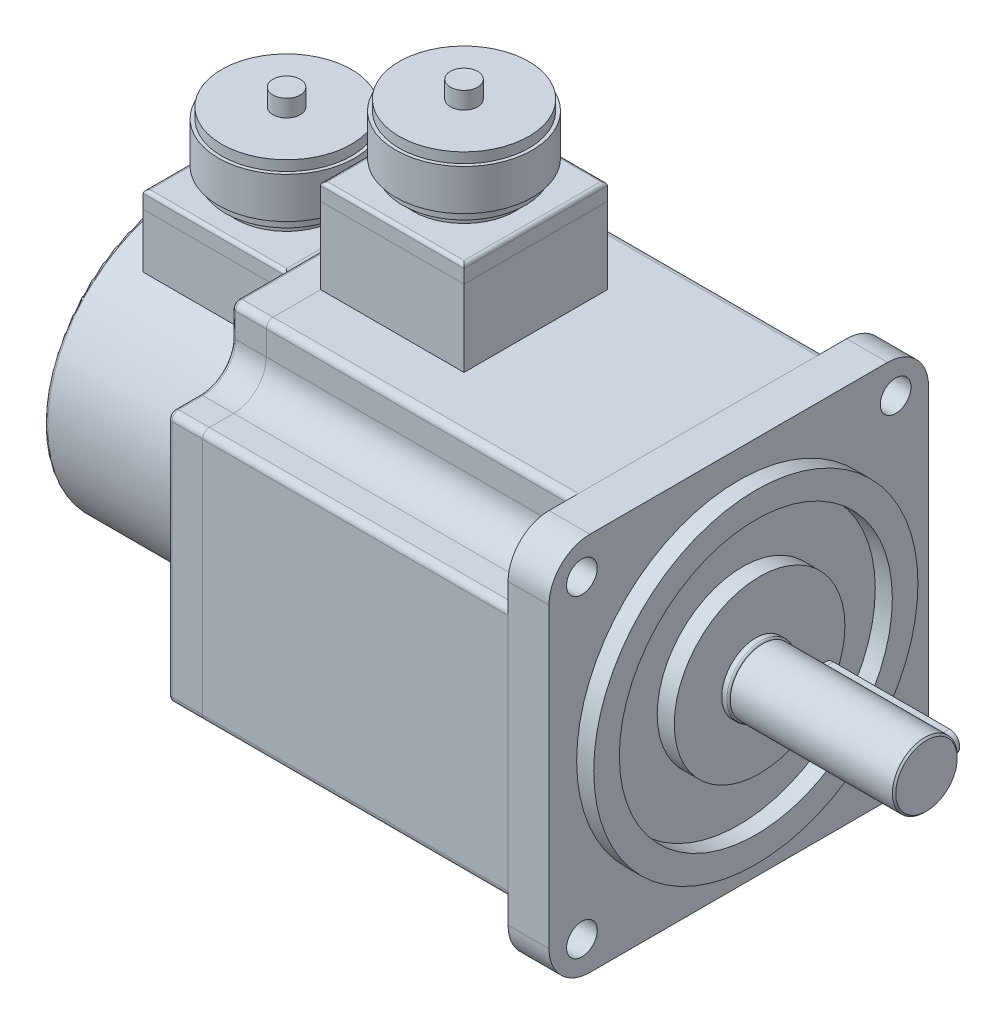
from build123d import *

# Parameters (mm, degrees)
EXTRUDE_1_DEPTH     = 10
EXTRUDE_2_DEPTH     = 89.5
EXTRUDE_3_DEPTH     = 12
CUT_EXTRUDE_1_DEPTH = 99.5
FILLET_1_R          = 1
SKETCH_7_R          = 4.5
CUT_EXTRUDE_2_DEPTH = 12
SKETCH_8_R          = 47.5
SKETCH_8_R_2        = 40
SKETCH_8_R_3        = 25
EXTRUDE_4_DEPTH     = 5
SKETCH_9_R          = 10
EXTRUDE_5_DEPTH     = 2
SKETCH_10_R         = 9.5
EXTRUDE_6_DEPTH     = 48
FILLET_2_R          = 0.5
CHAMFER_1_SIZE      = 0.5
SKETCH_13_R         = 40
EXTRUDE_8_DEPTH     = 52
SKETCH_14_W         = 42
SKETCH_14_H         = 42
CUT_EXTRUDE_4_DEPTH = 10
SKETCH_15_W         = 42
SKETCH_15_H         = 42
EXTRUDE_9_DEPTH     = 20
SKETCH_16_W         = 42
SKETCH_16_H         = 42
EXTRUDE_10_DEPTH    = 5
FILLET_3_R          = 1
SKETCH_17_R         = 15
EXTRUDE_11_DEPTH    = 3
SKETCH_18_R         = 18
EXTRUDE_12_DEPTH    = 3
SKETCH_19_R         = 20
EXTRUDE_13_DEPTH    = 12
SKETCH_20_R         = 19
EXTRUDE_14_DEPTH    = 3
SKETCH_21_R         = 4
EXTRUDE_15_DEPTH    = 5
SKETCH_22_W         = 42
SKETCH_22_H         = 42
EXTRUDE_16_DEPTH    = 22.4
SKETCH_23_W         = 42
SKETCH_23_H         = 42
EXTRUDE_17_DEPTH    = 5
FILLET_4_R          = 1
SKETCH_24_R         = 15
EXTRUDE_18_DEPTH    = 3
SKETCH_25_R         = 18
EXTRUDE_19_DEPTH    = 3
SKETCH_26_R         = 20
EXTRUDE_20_DEPTH    = 12
SKETCH_27_R         = 19
EXTRUDE_21_DEPTH    = 3
SKETCH_28_R         = 4
EXTRUDE_22_DEPTH    = 5
FILLET_5_R          = 1
CUT_EXTRUDE_5_DEPTH = 3.5
EXTRUDE_25_DEPTH    = 6


with BuildPart() as part:
    # Sketch 1 → Extrude 1 (new body)
    with BuildSketch(Plane(origin=(0, 0, 0), x_dir=(0, 0, -1), z_dir=(1, 0, 0))):
        with BuildLine():
            Line((-43.6, -55.6), (43.6, -55.6))
            ThreePointArc((43.6, -55.6), (52.085281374, -52.085281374), (55.6, -43.6))
            Line((55.6, -43.6), (55.6, 43.6))
            ThreePointArc((55.6, 43.6), (52.085281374, 52.085281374), (43.6, 55.6))
            Line((43.6, 55.6), (-43.6, 55.6))
            ThreePointArc((-43.6, 55.6), (-52.085281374, 52.085281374), (-55.6, 43.6))
            Line((-55.6, 43.6), (-55.6, -43.6))
            ThreePointArc((-55.6, -43.6), (-52.085281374, -52.085281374), (-43.6, -55.6))
        make_face()
    extrude(amount=EXTRUDE_1_DEPTH)


with BuildPart() as body_2:
    # Sketch 2 → Extrude 2 (new body)
    with BuildSketch(Plane(origin=(10, 0, 0), x_dir=(0, 0, -1), z_dir=(1, 0, 0))):
        with BuildLine():
            Line((-43.6, -55.6), (43.6, -55.6))
            ThreePointArc((43.6, -55.6), (52.085281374, -52.085281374), (55.6, -43.6))
            Line((55.6, -43.6), (55.6, 43.6))
            ThreePointArc((55.6, 43.6), (52.085281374, 52.085281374), (43.6, 55.6))
            Line((43.6, 55.6), (-43.6, 55.6))
            ThreePointArc((-43.6, 55.6), (-52.085281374, 52.085281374), (-55.6, 43.6))
            Line((-55.6, 43.6), (-55.6, -43.6))
            ThreePointArc((-55.6, -43.6), (-52.085281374, -52.085281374), (-43.6, -55.6))
        make_face()
    extrude(amount=EXTRUDE_2_DEPTH)


with BuildPart() as body_3:
    # Sketch 3 → Extrude 3 (new body)
    with BuildSketch(Plane(origin=(99.5, 0, 0), x_dir=(0, 0, -1), z_dir=(1, 0, 0))):
        with BuildLine():
            Line((-43.6, -55.6), (43.6, -55.6))
            ThreePointArc((43.6, -55.6), (52.085281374, -52.085281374), (55.6, -43.6))
            Line((55.6, -43.6), (55.6, 43.6))
            ThreePointArc((55.6, 43.6), (52.085281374, 52.085281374), (43.6, 55.6))
            Line((43.6, 55.6), (-43.6, 55.6))
            ThreePointArc((-43.6, 55.6), (-52.085281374, 52.085281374), (-55.6, 43.6))
            Line((-55.6, 43.6), (-55.6, -43.6))
            ThreePointArc((-55.6, -43.6), (-52.085281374, -52.085281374), (-43.6, -55.6))
        make_face()
    extrude(amount=EXTRUDE_3_DEPTH)

    # Sketch 7 → Cut-Extrude 2 (cut)
    with BuildSketch(Plane(origin=(111.5, 0, 0), x_dir=(0, 0, -1), z_dir=(1, 0, 0))):
        with Locations((-45.961940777, 45.961940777)):
            Circle(SKETCH_7_R)
        with Locations((45.961940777, 45.961940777)):
            Circle(SKETCH_7_R)
        with Locations((45.961940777, -45.961940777)):
            Circle(SKETCH_7_R)
        with Locations((-45.961940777, -45.961940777)):
            Circle(SKETCH_7_R)
    extrude(amount=-CUT_EXTRUDE_2_DEPTH, mode=Mode.SUBTRACT)

    # Sketch 8 → Extrude 4 (add)
    # profile 1 of 2: a face of its own
    with BuildSketch(Plane(origin=(111.5, 0, 0), x_dir=(0, 0, -1), z_dir=(1, 0, 0))):
        with Locations(Location((0, 0, 0), (0, 0, 180))):
            Circle(SKETCH_8_R)
        Circle(SKETCH_8_R_2, mode=Mode.SUBTRACT)
    # profile 2 of 2: a face of its own
    with BuildSketch(Plane(origin=(111.5, 0, 0), x_dir=(0, 0, -1), z_dir=(1, 0, 0))):
        with Locations(Location((1.103286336, 0, 0), (0, 0, 180))):
            Circle(SKETCH_8_R_3)
    extrude(amount=EXTRUDE_4_DEPTH)


with BuildPart() as cut_extrude_1_tool:
    # Sketch 6 → Cut-Extrude 1 (new body)
    with BuildSketch(Plane.ZY):
        with BuildLine():
            Line((-46.5, 36.949083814), (-53.6, 36.949083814))
            ThreePointArc((-53.6, 36.949083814), (-55.014213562, 36.363297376), (-55.6, 34.949083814))
            Line((-55.6, 34.949083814), (-55.6, 43.6))
            ThreePointArc((-55.6, 43.6), (-52.085281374, 52.085281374), (-43.6, 55.6))
            Line((-43.6, 55.6), (-34.949083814, 55.6))
            ThreePointArc((-34.949083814, 55.6), (-36.363297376, 55.014213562), (-36.949083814, 53.6))
            Line((-36.949083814, 53.6), (-36.949083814, 46.5))
            ThreePointArc((-36.949083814, 46.5), (-39.746482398, 39.746482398), (-46.5, 36.949083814))
        make_face()
        with BuildLine():
            Line((34.949083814, 55.6), (43.6, 55.6))
            ThreePointArc((43.6, 55.6), (52.085281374, 52.085281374), (55.6, 43.6))
            Line((55.6, 43.6), (55.6, 34.949083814))
            ThreePointArc((55.6, 34.949083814), (55.014213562, 36.363297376), (53.6, 36.949083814))
            Line((53.6, 36.949083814), (46.5, 36.949083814))
            ThreePointArc((46.5, 36.949083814), (39.746482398, 39.746482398), (36.949083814, 46.5))
            Line((36.949083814, 46.5), (36.949083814, 53.6))
            ThreePointArc((36.949083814, 53.6), (36.363297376, 55.014213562), (34.949083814, 55.6))
        make_face()
        with BuildLine():
            Line((-53.6, -36.949083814), (-46.5, -36.949083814))
            ThreePointArc((-46.5, -36.949083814), (-39.746482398, -39.746482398), (-36.949083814, -46.5))
            Line((-36.949083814, -46.5), (-36.949083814, -53.6))
            ThreePointArc((-36.949083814, -53.6), (-36.363297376, -55.014213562), (-34.949083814, -55.6))
            Line((-34.949083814, -55.6), (-43.6, -55.6))
            ThreePointArc((-43.6, -55.6), (-52.085281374, -52.085281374), (-55.6, -43.6))
            Line((-55.6, -43.6), (-55.6, -34.949083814))
            ThreePointArc((-55.6, -34.949083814), (-55.014213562, -36.363297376), (-53.6, -36.949083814))
        make_face()
        with BuildLine():
            Line((55.6, -34.949083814), (55.6, -43.6))
            ThreePointArc((55.6, -43.6), (52.085281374, -52.085281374), (43.6, -55.6))
            Line((43.6, -55.6), (34.949083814, -55.6))
            ThreePointArc((34.949083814, -55.6), (36.363297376, -55.014213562), (36.949083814, -53.6))
            Line((36.949083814, -53.6), (36.949083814, -46.5))
            ThreePointArc((36.949083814, -46.5), (39.746482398, -39.746482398), (46.5, -36.949083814))
            Line((46.5, -36.949083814), (53.6, -36.949083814))
            ThreePointArc((53.6, -36.949083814), (55.014213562, -36.363297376), (55.6, -34.949083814))
        make_face()
    extrude(amount=-CUT_EXTRUDE_1_DEPTH)


with BuildPart() as part_1:
    add(part.part)

    # Cut-Extrude 1: cut by cut_extrude_1_tool
    add(cut_extrude_1_tool.part, mode=Mode.SUBTRACT)

    # Fillet 1
    fillet_1_edges = [part_1.edges().sort_by_distance(p)[0] for p in [
        (0, 39.746482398, 39.746482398),
        (0, 36.949083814, 50.05),
        (0, 36.363297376, 55.014213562),
        (0, 55.014213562, 36.363297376),
        (0, 50.05, 36.949083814),
        (0, 0, 55.6),
        (0, 55.6, 0),
        (0, 0, -55.6),
        (0, -55.6, 0),
        (0, 55.014213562, -36.363297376),
        (0, 36.363297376, -55.014213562),
        (0, 36.949083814, -50.05),
        (0, 39.746482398, -39.746482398),
        (0, 50.05, -36.949083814),
        (0, -39.746482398, -39.746482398),
        (0, -36.949083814, -50.05),
        (0, -36.363297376, -55.014213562),
        (0, -55.014213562, -36.363297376),
        (0, -50.05, -36.949083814),
        (0, -39.746482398, 39.746482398),
        (0, -50.05, 36.949083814),
        (0, -55.014213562, 36.363297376),
        (0, -36.363297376, 55.014213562),
        (0, -36.949083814, 50.05),
    ]]
    fillet(fillet_1_edges, radius=FILLET_1_R)



with BuildPart() as body_2_1:
    add(body_2.part)

    # Cut-Extrude 1: cut by cut_extrude_1_tool
    add(cut_extrude_1_tool.part, mode=Mode.SUBTRACT)


with BuildPart() as body_4:
    # Sketch 9 → Extrude 5 (new body)
    with BuildSketch(Plane(origin=(116.5, 0, 0), x_dir=(0, 0, -1), z_dir=(1, 0, 0))):
        Circle(SKETCH_9_R)
    extrude(amount=EXTRUDE_5_DEPTH)

    # Fillet 2
    fillet_2_edges = [body_4.edges().sort_by_distance(p)[0] for p in [
        (118.5, 0, 10),
    ]]
    fillet(fillet_2_edges, radius=FILLET_2_R)


with BuildPart() as body_5:
    # Sketch 10 → Extrude 6 (new body)
    with BuildSketch(Plane(origin=(118.5, 0, 0), x_dir=(0, 0, -1), z_dir=(1, 0, 0))):
        Circle(SKETCH_10_R)
    extrude(amount=EXTRUDE_6_DEPTH)

    # Chamfer 1
    chamfer_1_edges = [body_5.edges().sort_by_distance(p)[0] for p in [
        (166.5, 0, 9.5),
    ]]
    chamfer(chamfer_1_edges, length=CHAMFER_1_SIZE)

    # Sketch 11 → Cut-Extrude 5 (cut)
    with BuildSketch(Plane.XY.offset(-9.75)):
        with BuildLine():
            Line((161, 3), (127, 3))
            ThreePointArc((127, 3), (124, 0), (127, -3))
            Line((127, -3), (161, -3))
            ThreePointArc((161, -3), (164, 0), (161, 3))
        make_face()
    extrude(amount=CUT_EXTRUDE_5_DEPTH, mode=Mode.SUBTRACT)


with BuildPart() as body_6:
    # Sketch 13 → Extrude 8 (new body)
    with BuildSketch(Plane.ZY):
        with Locations(Location((0, 0, 0), (0, 0, 180))):
            Circle(SKETCH_13_R)
    extrude(amount=EXTRUDE_8_DEPTH)

    # Sketch 14 → Cut-Extrude 4 (cut)
    with BuildSketch(Plane(origin=(0, 40, 0), x_dir=(1, 0, 0), z_dir=(0, 1, 0))):
        with Locations((-21, 0)):
            Rectangle(SKETCH_14_W, SKETCH_14_H)
    extrude(amount=-CUT_EXTRUDE_4_DEPTH, mode=Mode.SUBTRACT)


with BuildPart() as part_2:
    add(part_1.part)

    add(body_6.part)  # Extrude 9 merges body 6
    # Sketch 15 → Extrude 9 (add)
    with BuildSketch(Plane(origin=(0, 30, 0), x_dir=(1, 0, 0), z_dir=(0, 1, 0))):
        with Locations((-21, 0)):
            Rectangle(SKETCH_15_W, SKETCH_15_H)
    extrude(amount=EXTRUDE_9_DEPTH)

    # Fillet 5
    fillet_5_edges = [part_2.edges().sort_by_distance(p)[0] for p in [
        (-52, 0, 40),
    ]]
    fillet(fillet_5_edges, radius=FILLET_5_R)


with BuildPart() as body_6_2:
    # Sketch 16 → Extrude 10 (new body)
    with BuildSketch(Plane(origin=(0, 50, 0), x_dir=(1, 0, 0), z_dir=(0, 1, 0))):
        with Locations((-21, 0)):
            Rectangle(SKETCH_16_W, SKETCH_16_H)
    extrude(amount=EXTRUDE_10_DEPTH)

    # Fillet 3
    fillet_3_edges = [body_6_2.edges().sort_by_distance(p)[0] for p in [
        (-42, 55, 0),
        (-21, 55, 21),
        (0, 55, 0),
        (-21, 55, -21),
    ]]
    fillet(fillet_3_edges, radius=FILLET_3_R)


with BuildPart() as body_7:
    # Sketch 17 → Extrude 11 (new body)
    with BuildSketch(Plane(origin=(0, 55, 0), x_dir=(1, 0, 0), z_dir=(0, 1, 0))):
        with Locations(Location((-21, 0, 0), (0, 0, 270))):
            Circle(SKETCH_17_R)
    extrude(amount=EXTRUDE_11_DEPTH)

    # Sketch 18 → Extrude 12 (add)
    with BuildSketch(Plane(origin=(0, 58, 0), x_dir=(1, 0, 0), z_dir=(0, 1, 0))):
        with Locations(Location((-21, 0, 0), (0, 0, 270))):
            Circle(SKETCH_18_R)
    extrude(amount=EXTRUDE_12_DEPTH)

    # Sketch 19 → Extrude 13 (add)
    with BuildSketch(Plane(origin=(0, 61, 0), x_dir=(1, 0, 0), z_dir=(0, 1, 0))):
        with Locations(Location((-21, 0, 0), (0, 0, 270))):
            Circle(SKETCH_19_R)
    extrude(amount=EXTRUDE_13_DEPTH)

    # Sketch 20 → Extrude 14 (add)
    with BuildSketch(Plane(origin=(0, 73, 0), x_dir=(1, 0, 0), z_dir=(0, 1, 0))):
        with Locations(Location((-21, 0, 0), (0, 0, 270))):
            Circle(SKETCH_20_R)
    extrude(amount=EXTRUDE_14_DEPTH)

    # Sketch 21 → Extrude 15 (add)
    with BuildSketch(Plane(origin=(0, 76, 0), x_dir=(1, 0, 0), z_dir=(0, 1, 0))):
        with Locations(Location((-21, 0, 0), (0, 0, 270))):
            Circle(SKETCH_21_R)
    extrude(amount=EXTRUDE_15_DEPTH)


with BuildPart() as body_8:
    # Sketch 22 → Extrude 16 (new body)
    with BuildSketch(Plane(origin=(0, 55.6, 0), x_dir=(1, 0, 0), z_dir=(0, 1, 0))):
        with Locations((31, 0)):
            Rectangle(SKETCH_22_W, SKETCH_22_H)
    extrude(amount=EXTRUDE_16_DEPTH)


with BuildPart() as body_9:
    # Sketch 23 → Extrude 17 (new body)
    with BuildSketch(Plane(origin=(0, 78, 0), x_dir=(1, 0, 0), z_dir=(0, 1, 0))):
        with Locations((31, 0)):
            Rectangle(SKETCH_23_W, SKETCH_23_H)
    extrude(amount=EXTRUDE_17_DEPTH)

    # Fillet 4
    fillet_4_edges = [body_9.edges().sort_by_distance(p)[0] for p in [
        (10, 83, 0),
        (31, 83, 21),
        (52, 83, 0),
        (31, 83, -21),
    ]]
    fillet(fillet_4_edges, radius=FILLET_4_R)


with BuildPart() as body_10:
    # Sketch 24 → Extrude 18 (new body)
    with BuildSketch(Plane(origin=(0, 83, 0), x_dir=(1, 0, 0), z_dir=(0, 1, 0))):
        with Locations(Location((31, 0, 0), (0, 0, 270))):
            Circle(SKETCH_24_R)
    extrude(amount=EXTRUDE_18_DEPTH)


with BuildPart() as body_11:
    # Sketch 25 → Extrude 19 (new body)
    with BuildSketch(Plane(origin=(0, 86, 0), x_dir=(1, 0, 0), z_dir=(0, 1, 0))):
        with Locations(Location((31, 0, 0), (0, 0, 270))):
            Circle(SKETCH_25_R)
    extrude(amount=EXTRUDE_19_DEPTH)


with BuildPart() as body_12:
    # Sketch 26 → Extrude 20 (new body)
    with BuildSketch(Plane(origin=(0, 89, 0), x_dir=(1, 0, 0), z_dir=(0, 1, 0))):
        with Locations(Location((31, 0, 0), (0, 0, 270))):
            Circle(SKETCH_26_R)
    extrude(amount=EXTRUDE_20_DEPTH)


with BuildPart() as body_13:
    # Sketch 27 → Extrude 21 (new body)
    with BuildSketch(Plane(origin=(0, 101, 0), x_dir=(1, 0, 0), z_dir=(0, 1, 0))):
        with Locations(Location((31, 0, 0), (0, 0, 270))):
            Circle(SKETCH_27_R)
    extrude(amount=EXTRUDE_21_DEPTH)


with BuildPart() as body_14:
    # Sketch 28 → Extrude 22 (new body)
    with BuildSketch(Plane(origin=(0, 104, 0), x_dir=(1, 0, 0), z_dir=(0, 1, 0))):
        with Locations(Location((31, 0, 0), (0, 0, 270))):
            Circle(SKETCH_28_R)
    extrude(amount=EXTRUDE_22_DEPTH)


with BuildPart() as body_15:
    # Sketch 33 → Extrude 25 (new body)
    with BuildSketch(Plane(origin=(0, 0, -6.25), x_dir=(-1, 0, 0), z_dir=(0, 0, -1))):
        with BuildLine():
            Line((-161, 3), (-127, 3))
            ThreePointArc((-127, 3), (-124, 0), (-127, -3))
            Line((-127, -3), (-161, -3))
            ThreePointArc((-161, -3), (-164, 0), (-161, 3))
        make_face()
    extrude(amount=EXTRUDE_25_DEPTH)


solid = Compound([body_3.part, body_2_1.part, body_4.part, body_5.part, part_2.part, body_6_2.part, body_7.part, body_8.part, body_9.part, body_10.part, body_11.part, body_12.part, body_13.part, body_14.part, body_15.part])
